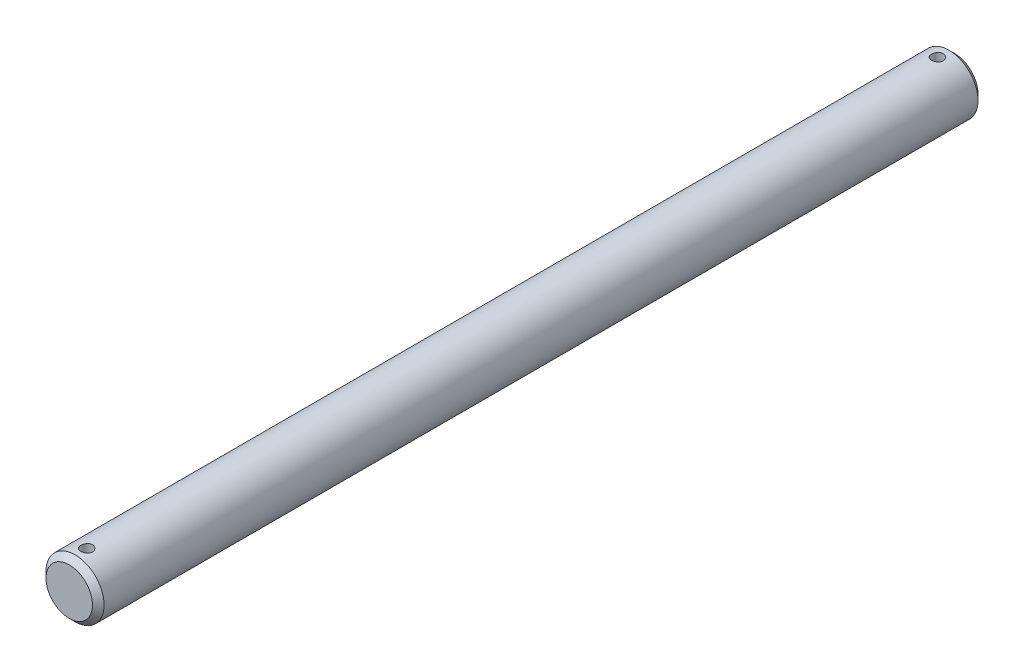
from build123d import *

# Parameters (mm, degrees)
ESQUISSE1_R                  = 10
EXTRUSION1_DEPTH             = 305
ENL_V_MAT_EXTRU_1_DEPTH      = 300
ENL_V_MAT_EXTRU_1_DEPTH_BACK = 306.327692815
ESQUISSE2_R                  = 2
CHANFREIN1_SIZE              = 2


with BuildPart() as part:
    # Esquisse1 → Extrusion1 (new body)
    with BuildSketch(Plane.XY):
        Circle(ESQUISSE1_R)
    extrude(amount=EXTRUSION1_DEPTH)

    # Esquisse2 → Enl_v. mat.-Extru.1 (cut, two sides: drawn at the far end of the back side and taken through both)
    with BuildSketch(Plane(origin=(0, 0, 0), x_dir=(1, 0, 0), z_dir=(0, 1, 0)).offset(-ENL_V_MAT_EXTRU_1_DEPTH_BACK)):
        with Locations(Location((0, -6, 0), (0, 0, 90))):
            Circle(ESQUISSE2_R)
        with Locations(Location((0, -299, 0), (0, 0, 90))):
            Circle(ESQUISSE2_R)
    extrude(amount=ENL_V_MAT_EXTRU_1_DEPTH + ENL_V_MAT_EXTRU_1_DEPTH_BACK, mode=Mode.SUBTRACT)

    # Chanfrein1
    chanfrein1_edges = [part.edges().sort_by_distance(p)[0] for p in [
        (-10, 0, 0),
        (-10, 0, 305),
    ]]
    chamfer(chanfrein1_edges, length=CHANFREIN1_SIZE)


solid = part.part
